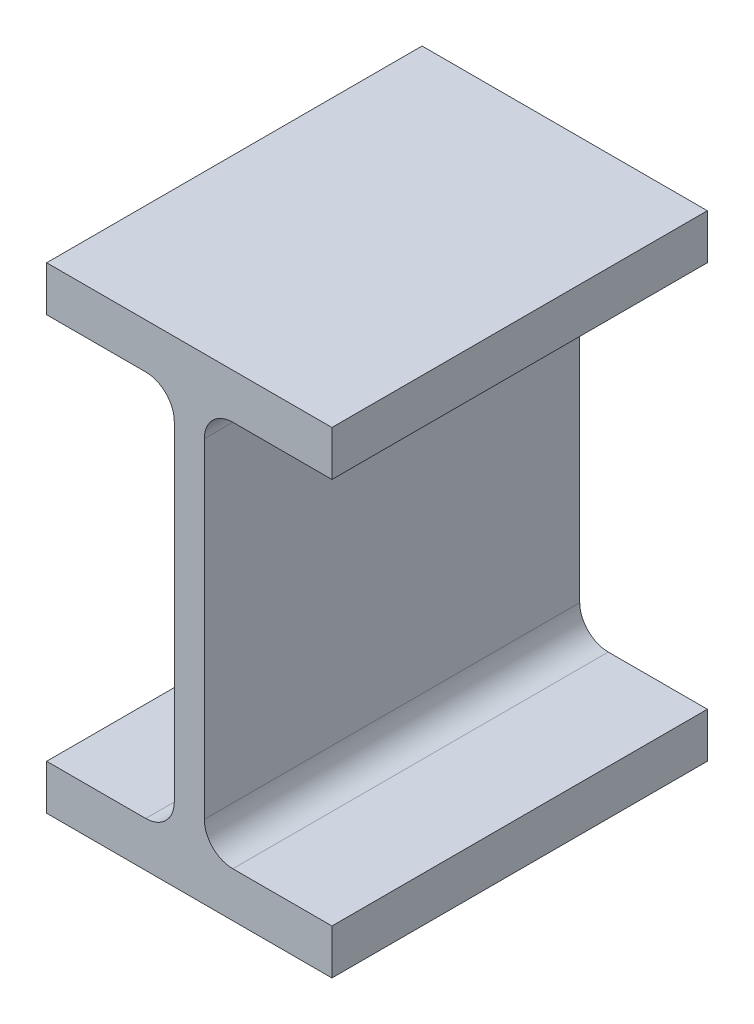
ISO-10303-21;
HEADER;
FILE_DESCRIPTION(('STEP AP214'),'2;1');
FILE_NAME('part.step','',(''),(''),'','','');
FILE_SCHEMA(('AUTOMOTIVE_DESIGN { 1 0 10303 214 1 1 1 1 }'));
ENDSEC;
DATA;
#1=APPLICATION_CONTEXT('core data for automotive mechanical design processes');
#2=APPLICATION_PROTOCOL_DEFINITION('international standard','automotive_design',2000,#1);
#3=PRODUCT_CONTEXT('',#1,'mechanical');
#4=PRODUCT('Part','Part','',(#3));
#5=PRODUCT_RELATED_PRODUCT_CATEGORY('part','',(#4));
#6=PRODUCT_DEFINITION_FORMATION('','',#4);
#7=PRODUCT_DEFINITION_CONTEXT('part definition',#1,'design');
#8=PRODUCT_DEFINITION('design','',#6,#7);
#9=PRODUCT_DEFINITION_SHAPE('','',#8);
#10=(LENGTH_UNIT() NAMED_UNIT(*) SI_UNIT(.MILLI.,.METRE.));
#11=(NAMED_UNIT(*) PLANE_ANGLE_UNIT() SI_UNIT($,.RADIAN.));
#12=(NAMED_UNIT(*) SI_UNIT($,.STERADIAN.) SOLID_ANGLE_UNIT());
#13=UNCERTAINTY_MEASURE_WITH_UNIT(LENGTH_MEASURE(1.E-05),#10,'distance_accuracy_value','');
#14=(GEOMETRIC_REPRESENTATION_CONTEXT(3) GLOBAL_UNCERTAINTY_ASSIGNED_CONTEXT((#13)) GLOBAL_UNIT_ASSIGNED_CONTEXT((#10,
#11,#12)) REPRESENTATION_CONTEXT('',''));
#15=CARTESIAN_POINT('',(0.,0.,0.));
#16=DIRECTION('',(0.,0.,1.));
#17=DIRECTION('',(1.,0.,0.));
#18=AXIS2_PLACEMENT_3D('',#15,#16,#17);
#19=CARTESIAN_POINT('',(-38.,12.,50.));
#20=DIRECTION('',(1.,0.,0.));
#21=DIRECTION('',(0.,1.,0.));
#22=AXIS2_PLACEMENT_3D('',#19,#20,#21);
#23=PLANE('',#22);
#24=DIRECTION('',(0.,-1.,0.));
#25=VECTOR('',#24,1.);
#26=CARTESIAN_POINT('',(-38.,12.,-50.));
#27=LINE('',#26,#25);
#28=CARTESIAN_POINT('',(-38.,12.,-50.));
#29=VERTEX_POINT('',#28);
#30=CARTESIAN_POINT('',(-38.,0.,-50.));
#31=VERTEX_POINT('',#30);
#32=EDGE_CURVE('E176',#29,#31,#27,.T.);
#33=ORIENTED_EDGE('',*,*,#32,.T.);
#34=DIRECTION('',(0.,0.,-1.));
#35=VECTOR('',#34,1.);
#36=CARTESIAN_POINT('',(-38.,0.,50.));
#37=LINE('',#36,#35);
#38=CARTESIAN_POINT('',(-38.,0.,50.));
#39=VERTEX_POINT('',#38);
#40=EDGE_CURVE('E11',#39,#31,#37,.T.);
#41=ORIENTED_EDGE('',*,*,#40,.F.);
#42=DIRECTION('',(0.,-1.,0.));
#43=VECTOR('',#42,1.);
#44=CARTESIAN_POINT('',(-38.,12.,50.));
#45=LINE('',#44,#43);
#46=CARTESIAN_POINT('',(-38.,12.,50.));
#47=VERTEX_POINT('',#46);
#48=EDGE_CURVE('E206',#47,#39,#45,.T.);
#49=ORIENTED_EDGE('',*,*,#48,.F.);
#50=DIRECTION('',(0.,0.,-1.));
#51=VECTOR('',#50,1.);
#52=CARTESIAN_POINT('',(-38.,12.,50.));
#53=LINE('',#52,#51);
#54=EDGE_CURVE('E172',#47,#29,#53,.T.);
#55=ORIENTED_EDGE('',*,*,#54,.T.);
#56=EDGE_LOOP('',(#33,#41,#49,#55));
#57=FACE_BOUND('',#56,.T.);
#58=ADVANCED_FACE('F32',(#57),#23,.F.);
#59=CARTESIAN_POINT('',(-38.,0.,50.));
#60=DIRECTION('',(0.,1.,0.));
#61=DIRECTION('',(-1.,0.,0.));
#62=AXIS2_PLACEMENT_3D('',#59,#60,#61);
#63=PLANE('',#62);
#64=DIRECTION('',(1.,0.,0.));
#65=VECTOR('',#64,1.);
#66=CARTESIAN_POINT('',(-38.,0.,-50.));
#67=LINE('',#66,#65);
#68=CARTESIAN_POINT('',(38.,0.,-50.));
#69=VERTEX_POINT('',#68);
#70=EDGE_CURVE('E179',#31,#69,#67,.T.);
#71=ORIENTED_EDGE('',*,*,#70,.T.);
#72=DIRECTION('',(0.,0.,-1.));
#73=VECTOR('',#72,1.);
#74=CARTESIAN_POINT('',(38.,0.,50.));
#75=LINE('',#74,#73);
#76=CARTESIAN_POINT('',(38.,0.,50.));
#77=VERTEX_POINT('',#76);
#78=EDGE_CURVE('E40',#77,#69,#75,.T.);
#79=ORIENTED_EDGE('',*,*,#78,.F.);
#80=DIRECTION('',(1.,0.,0.));
#81=VECTOR('',#80,1.);
#82=CARTESIAN_POINT('',(-38.,0.,50.));
#83=LINE('',#82,#81);
#84=EDGE_CURVE('E115',#39,#77,#83,.T.);
#85=ORIENTED_EDGE('',*,*,#84,.F.);
#86=ORIENTED_EDGE('',*,*,#40,.T.);
#87=EDGE_LOOP('',(#71,#79,#85,#86));
#88=FACE_BOUND('',#87,.T.);
#89=ADVANCED_FACE('F304',(#88),#63,.F.);
#90=CARTESIAN_POINT('',(38.,0.,50.));
#91=DIRECTION('',(-1.,0.,0.));
#92=DIRECTION('',(0.,-1.,0.));
#93=AXIS2_PLACEMENT_3D('',#90,#91,#92);
#94=PLANE('',#93);
#95=DIRECTION('',(0.,1.,0.));
#96=VECTOR('',#95,1.);
#97=CARTESIAN_POINT('',(38.,0.,-50.));
#98=LINE('',#97,#96);
#99=CARTESIAN_POINT('',(38.,12.,-50.));
#100=VERTEX_POINT('',#99);
#101=EDGE_CURVE('E181',#69,#100,#98,.T.);
#102=ORIENTED_EDGE('',*,*,#101,.T.);
#103=DIRECTION('',(0.,0.,-1.));
#104=VECTOR('',#103,1.);
#105=CARTESIAN_POINT('',(38.,12.,50.));
#106=LINE('',#105,#104);
#107=CARTESIAN_POINT('',(38.,12.,50.));
#108=VERTEX_POINT('',#107);
#109=EDGE_CURVE('E237',#108,#100,#106,.T.);
#110=ORIENTED_EDGE('',*,*,#109,.F.);
#111=DIRECTION('',(0.,1.,0.));
#112=VECTOR('',#111,1.);
#113=CARTESIAN_POINT('',(38.,0.,50.));
#114=LINE('',#113,#112);
#115=EDGE_CURVE('E245',#77,#108,#114,.T.);
#116=ORIENTED_EDGE('',*,*,#115,.F.);
#117=ORIENTED_EDGE('',*,*,#78,.T.);
#118=EDGE_LOOP('',(#102,#110,#116,#117));
#119=FACE_BOUND('',#118,.T.);
#120=ADVANCED_FACE('F243',(#119),#94,.F.);
#121=CARTESIAN_POINT('',(38.,12.,50.));
#122=DIRECTION('',(0.,-1.,0.));
#123=DIRECTION('',(1.,0.,0.));
#124=AXIS2_PLACEMENT_3D('',#121,#122,#123);
#125=PLANE('',#124);
#126=DIRECTION('',(-1.,0.,0.));
#127=VECTOR('',#126,1.);
#128=CARTESIAN_POINT('',(38.,12.,-50.));
#129=LINE('',#128,#127);
#130=CARTESIAN_POINT('',(11.6,12.,-50.));
#131=VERTEX_POINT('',#130);
#132=EDGE_CURVE('E183',#100,#131,#129,.T.);
#133=ORIENTED_EDGE('',*,*,#132,.T.);
#134=DIRECTION('',(0.,0.,-1.));
#135=VECTOR('',#134,1.);
#136=CARTESIAN_POINT('',(11.6,12.,50.));
#137=LINE('',#136,#135);
#138=CARTESIAN_POINT('',(11.6,12.,50.));
#139=VERTEX_POINT('',#138);
#140=EDGE_CURVE('E234',#139,#131,#137,.T.);
#141=ORIENTED_EDGE('',*,*,#140,.F.);
#142=DIRECTION('',(-1.,0.,0.));
#143=VECTOR('',#142,1.);
#144=CARTESIAN_POINT('',(38.,12.,50.));
#145=LINE('',#144,#143);
#146=EDGE_CURVE('E263',#108,#139,#145,.T.);
#147=ORIENTED_EDGE('',*,*,#146,.F.);
#148=ORIENTED_EDGE('',*,*,#109,.T.);
#149=EDGE_LOOP('',(#133,#141,#147,#148));
#150=FACE_BOUND('',#149,.T.);
#151=ADVANCED_FACE('F254',(#150),#125,.F.);
#152=CARTESIAN_POINT('',(11.6,19.6,50.));
#153=DIRECTION('',(0.,0.,-1.));
#154=DIRECTION('',(-1.,0.,0.));
#155=AXIS2_PLACEMENT_3D('',#152,#153,#154);
#156=CYLINDRICAL_SURFACE('',#155,7.6);
#157=CARTESIAN_POINT('',(11.6,19.6,-50.));
#158=DIRECTION('',(0.,0.,-1.));
#159=DIRECTION('',(-1.,0.,0.));
#160=AXIS2_PLACEMENT_3D('',#157,#158,#159);
#161=CIRCLE('',#160,7.6);
#162=CARTESIAN_POINT('',(4.,19.6,-50.));
#163=VERTEX_POINT('',#162);
#164=EDGE_CURVE('E185',#131,#163,#161,.T.);
#165=ORIENTED_EDGE('',*,*,#164,.T.);
#166=DIRECTION('',(0.,0.,-1.));
#167=VECTOR('',#166,1.);
#168=CARTESIAN_POINT('',(4.,19.6,50.));
#169=LINE('',#168,#167);
#170=CARTESIAN_POINT('',(4.,19.6,50.));
#171=VERTEX_POINT('',#170);
#172=EDGE_CURVE('E231',#171,#163,#169,.T.);
#173=ORIENTED_EDGE('',*,*,#172,.F.);
#174=CARTESIAN_POINT('',(11.6,19.6,50.));
#175=DIRECTION('',(0.,0.,-1.));
#176=DIRECTION('',(-1.,0.,0.));
#177=AXIS2_PLACEMENT_3D('',#174,#175,#176);
#178=CIRCLE('',#177,7.6);
#179=EDGE_CURVE('E260',#139,#171,#178,.T.);
#180=ORIENTED_EDGE('',*,*,#179,.F.);
#181=ORIENTED_EDGE('',*,*,#140,.T.);
#182=EDGE_LOOP('',(#165,#173,#180,#181));
#183=FACE_BOUND('',#182,.T.);
#184=ADVANCED_FACE('F258',(#183),#156,.F.);
#185=CARTESIAN_POINT('',(4.,19.6,50.));
#186=DIRECTION('',(-1.,0.,0.));
#187=DIRECTION('',(0.,0.,1.));
#188=AXIS2_PLACEMENT_3D('',#185,#186,#187);
#189=PLANE('',#188);
#190=DIRECTION('',(0.,1.,0.));
#191=VECTOR('',#190,1.);
#192=CARTESIAN_POINT('',(4.,19.6,-50.));
#193=LINE('',#192,#191);
#194=CARTESIAN_POINT('',(4.,107.4,-50.));
#195=VERTEX_POINT('',#194);
#196=EDGE_CURVE('E187',#163,#195,#193,.T.);
#197=ORIENTED_EDGE('',*,*,#196,.T.);
#198=DIRECTION('',(0.,0.,-1.));
#199=VECTOR('',#198,1.);
#200=CARTESIAN_POINT('',(4.,107.4,50.));
#201=LINE('',#200,#199);
#202=CARTESIAN_POINT('',(4.,107.4,50.));
#203=VERTEX_POINT('',#202);
#204=EDGE_CURVE('E228',#203,#195,#201,.T.);
#205=ORIENTED_EDGE('',*,*,#204,.F.);
#206=DIRECTION('',(0.,1.,0.));
#207=VECTOR('',#206,1.);
#208=CARTESIAN_POINT('',(4.,19.6,50.));
#209=LINE('',#208,#207);
#210=EDGE_CURVE('E262',#171,#203,#209,.T.);
#211=ORIENTED_EDGE('',*,*,#210,.F.);
#212=ORIENTED_EDGE('',*,*,#172,.T.);
#213=EDGE_LOOP('',(#197,#205,#211,#212));
#214=FACE_BOUND('',#213,.T.);
#215=ADVANCED_FACE('F317',(#214),#189,.F.);
#216=CARTESIAN_POINT('',(11.6,107.4,50.));
#217=DIRECTION('',(0.,0.,-1.));
#218=DIRECTION('',(-1.,0.,0.));
#219=AXIS2_PLACEMENT_3D('',#216,#217,#218);
#220=CYLINDRICAL_SURFACE('',#219,7.6);
#221=CARTESIAN_POINT('',(11.6,107.4,-50.));
#222=DIRECTION('',(0.,0.,-1.));
#223=DIRECTION('',(-1.,0.,0.));
#224=AXIS2_PLACEMENT_3D('',#221,#222,#223);
#225=CIRCLE('',#224,7.6);
#226=CARTESIAN_POINT('',(11.6,115.,-50.));
#227=VERTEX_POINT('',#226);
#228=EDGE_CURVE('E189',#195,#227,#225,.T.);
#229=ORIENTED_EDGE('',*,*,#228,.T.);
#230=DIRECTION('',(0.,0.,-1.));
#231=VECTOR('',#230,1.);
#232=CARTESIAN_POINT('',(11.6,115.,50.));
#233=LINE('',#232,#231);
#234=CARTESIAN_POINT('',(11.6,115.,50.));
#235=VERTEX_POINT('',#234);
#236=EDGE_CURVE('E225',#235,#227,#233,.T.);
#237=ORIENTED_EDGE('',*,*,#236,.F.);
#238=CARTESIAN_POINT('',(11.6,107.4,50.));
#239=DIRECTION('',(0.,0.,-1.));
#240=DIRECTION('',(-1.,0.,0.));
#241=AXIS2_PLACEMENT_3D('',#238,#239,#240);
#242=CIRCLE('',#241,7.6);
#243=EDGE_CURVE('E265',#203,#235,#242,.T.);
#244=ORIENTED_EDGE('',*,*,#243,.F.);
#245=ORIENTED_EDGE('',*,*,#204,.T.);
#246=EDGE_LOOP('',(#229,#237,#244,#245));
#247=FACE_BOUND('',#246,.T.);
#248=ADVANCED_FACE('F320',(#247),#220,.F.);
#249=CARTESIAN_POINT('',(11.6,115.,50.));
#250=DIRECTION('',(0.,1.,0.));
#251=DIRECTION('',(-1.,0.,0.));
#252=AXIS2_PLACEMENT_3D('',#249,#250,#251);
#253=PLANE('',#252);
#254=DIRECTION('',(1.,0.,0.));
#255=VECTOR('',#254,1.);
#256=CARTESIAN_POINT('',(11.6,115.,-50.));
#257=LINE('',#256,#255);
#258=CARTESIAN_POINT('',(38.,115.,-50.));
#259=VERTEX_POINT('',#258);
#260=EDGE_CURVE('E191',#227,#259,#257,.T.);
#261=ORIENTED_EDGE('',*,*,#260,.T.);
#262=DIRECTION('',(0.,0.,-1.));
#263=VECTOR('',#262,1.);
#264=CARTESIAN_POINT('',(38.,115.,50.));
#265=LINE('',#264,#263);
#266=CARTESIAN_POINT('',(38.,115.,50.));
#267=VERTEX_POINT('',#266);
#268=EDGE_CURVE('E222',#267,#259,#265,.T.);
#269=ORIENTED_EDGE('',*,*,#268,.F.);
#270=DIRECTION('',(1.,0.,0.));
#271=VECTOR('',#270,1.);
#272=CARTESIAN_POINT('',(11.6,115.,50.));
#273=LINE('',#272,#271);
#274=EDGE_CURVE('E271',#235,#267,#273,.T.);
#275=ORIENTED_EDGE('',*,*,#274,.F.);
#276=ORIENTED_EDGE('',*,*,#236,.T.);
#277=EDGE_LOOP('',(#261,#269,#275,#276));
#278=FACE_BOUND('',#277,.T.);
#279=ADVANCED_FACE('F324',(#278),#253,.F.);
#280=CARTESIAN_POINT('',(38.,115.,50.));
#281=DIRECTION('',(-1.,0.,0.));
#282=DIRECTION('',(0.,0.,1.));
#283=AXIS2_PLACEMENT_3D('',#280,#281,#282);
#284=PLANE('',#283);
#285=DIRECTION('',(0.,1.,0.));
#286=VECTOR('',#285,1.);
#287=CARTESIAN_POINT('',(38.,115.,-50.));
#288=LINE('',#287,#286);
#289=CARTESIAN_POINT('',(38.,127.,-50.));
#290=VERTEX_POINT('',#289);
#291=EDGE_CURVE('E193',#259,#290,#288,.T.);
#292=ORIENTED_EDGE('',*,*,#291,.T.);
#293=DIRECTION('',(0.,0.,-1.));
#294=VECTOR('',#293,1.);
#295=CARTESIAN_POINT('',(38.,127.,50.));
#296=LINE('',#295,#294);
#297=CARTESIAN_POINT('',(38.,127.,50.));
#298=VERTEX_POINT('',#297);
#299=EDGE_CURVE('E219',#298,#290,#296,.T.);
#300=ORIENTED_EDGE('',*,*,#299,.F.);
#301=DIRECTION('',(0.,1.,0.));
#302=VECTOR('',#301,1.);
#303=CARTESIAN_POINT('',(38.,115.,50.));
#304=LINE('',#303,#302);
#305=EDGE_CURVE('E273',#267,#298,#304,.T.);
#306=ORIENTED_EDGE('',*,*,#305,.F.);
#307=ORIENTED_EDGE('',*,*,#268,.T.);
#308=EDGE_LOOP('',(#292,#300,#306,#307));
#309=FACE_BOUND('',#308,.T.);
#310=ADVANCED_FACE('F328',(#309),#284,.F.);
#311=CARTESIAN_POINT('',(38.,127.,50.));
#312=DIRECTION('',(0.,-1.,0.));
#313=DIRECTION('',(1.,0.,0.));
#314=AXIS2_PLACEMENT_3D('',#311,#312,#313);
#315=PLANE('',#314);
#316=DIRECTION('',(-1.,0.,0.));
#317=VECTOR('',#316,1.);
#318=CARTESIAN_POINT('',(38.,127.,-50.));
#319=LINE('',#318,#317);
#320=CARTESIAN_POINT('',(-38.,127.,-50.));
#321=VERTEX_POINT('',#320);
#322=EDGE_CURVE('E195',#290,#321,#319,.T.);
#323=ORIENTED_EDGE('',*,*,#322,.T.);
#324=DIRECTION('',(0.,0.,-1.));
#325=VECTOR('',#324,1.);
#326=CARTESIAN_POINT('',(-38.,127.,50.));
#327=LINE('',#326,#325);
#328=CARTESIAN_POINT('',(-38.,127.,50.));
#329=VERTEX_POINT('',#328);
#330=EDGE_CURVE('E216',#329,#321,#327,.T.);
#331=ORIENTED_EDGE('',*,*,#330,.F.);
#332=DIRECTION('',(-1.,0.,0.));
#333=VECTOR('',#332,1.);
#334=CARTESIAN_POINT('',(38.,127.,50.));
#335=LINE('',#334,#333);
#336=EDGE_CURVE('E275',#298,#329,#335,.T.);
#337=ORIENTED_EDGE('',*,*,#336,.F.);
#338=ORIENTED_EDGE('',*,*,#299,.T.);
#339=EDGE_LOOP('',(#323,#331,#337,#338));
#340=FACE_BOUND('',#339,.T.);
#341=ADVANCED_FACE('F332',(#340),#315,.F.);
#342=CARTESIAN_POINT('',(-38.,127.,50.));
#343=DIRECTION('',(1.,0.,0.));
#344=DIRECTION('',(0.,0.,-1.));
#345=AXIS2_PLACEMENT_3D('',#342,#343,#344);
#346=PLANE('',#345);
#347=DIRECTION('',(0.,-1.,0.));
#348=VECTOR('',#347,1.);
#349=CARTESIAN_POINT('',(-38.,127.,-50.));
#350=LINE('',#349,#348);
#351=CARTESIAN_POINT('',(-38.,115.,-50.));
#352=VERTEX_POINT('',#351);
#353=EDGE_CURVE('E197',#321,#352,#350,.T.);
#354=ORIENTED_EDGE('',*,*,#353,.T.);
#355=DIRECTION('',(0.,0.,-1.));
#356=VECTOR('',#355,1.);
#357=CARTESIAN_POINT('',(-38.,115.,50.));
#358=LINE('',#357,#356);
#359=CARTESIAN_POINT('',(-38.,115.,50.));
#360=VERTEX_POINT('',#359);
#361=EDGE_CURVE('E213',#360,#352,#358,.T.);
#362=ORIENTED_EDGE('',*,*,#361,.F.);
#363=DIRECTION('',(0.,-1.,0.));
#364=VECTOR('',#363,1.);
#365=CARTESIAN_POINT('',(-38.,127.,50.));
#366=LINE('',#365,#364);
#367=EDGE_CURVE('E277',#329,#360,#366,.T.);
#368=ORIENTED_EDGE('',*,*,#367,.F.);
#369=ORIENTED_EDGE('',*,*,#330,.T.);
#370=EDGE_LOOP('',(#354,#362,#368,#369));
#371=FACE_BOUND('',#370,.T.);
#372=ADVANCED_FACE('F336',(#371),#346,.F.);
#373=CARTESIAN_POINT('',(-38.,115.,50.));
#374=DIRECTION('',(0.,1.,0.));
#375=DIRECTION('',(0.,0.,1.));
#376=AXIS2_PLACEMENT_3D('',#373,#374,#375);
#377=PLANE('',#376);
#378=DIRECTION('',(1.,0.,0.));
#379=VECTOR('',#378,1.);
#380=CARTESIAN_POINT('',(-38.,115.,-50.));
#381=LINE('',#380,#379);
#382=CARTESIAN_POINT('',(-11.6,115.,-50.));
#383=VERTEX_POINT('',#382);
#384=EDGE_CURVE('E199',#352,#383,#381,.T.);
#385=ORIENTED_EDGE('',*,*,#384,.T.);
#386=DIRECTION('',(0.,0.,-1.));
#387=VECTOR('',#386,1.);
#388=CARTESIAN_POINT('',(-11.6,115.,50.));
#389=LINE('',#388,#387);
#390=CARTESIAN_POINT('',(-11.6,115.,50.));
#391=VERTEX_POINT('',#390);
#392=EDGE_CURVE('E210',#391,#383,#389,.T.);
#393=ORIENTED_EDGE('',*,*,#392,.F.);
#394=DIRECTION('',(1.,0.,0.));
#395=VECTOR('',#394,1.);
#396=CARTESIAN_POINT('',(-38.,115.,50.));
#397=LINE('',#396,#395);
#398=EDGE_CURVE('E279',#360,#391,#397,.T.);
#399=ORIENTED_EDGE('',*,*,#398,.F.);
#400=ORIENTED_EDGE('',*,*,#361,.T.);
#401=EDGE_LOOP('',(#385,#393,#399,#400));
#402=FACE_BOUND('',#401,.T.);
#403=ADVANCED_FACE('F285',(#402),#377,.F.);
#404=CARTESIAN_POINT('',(-11.6,107.4,50.));
#405=DIRECTION('',(0.,0.,-1.));
#406=DIRECTION('',(-1.,0.,0.));
#407=AXIS2_PLACEMENT_3D('',#404,#405,#406);
#408=CYLINDRICAL_SURFACE('',#407,7.6);
#409=CARTESIAN_POINT('',(-11.6,107.4,-50.));
#410=DIRECTION('',(0.,0.,-1.));
#411=DIRECTION('',(-1.,0.,0.));
#412=AXIS2_PLACEMENT_3D('',#409,#410,#411);
#413=CIRCLE('',#412,7.6);
#414=CARTESIAN_POINT('',(-4.00000000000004,107.4,-50.));
#415=VERTEX_POINT('',#414);
#416=EDGE_CURVE('E201',#383,#415,#413,.T.);
#417=ORIENTED_EDGE('',*,*,#416,.T.);
#418=DIRECTION('',(0.,0.,-1.));
#419=VECTOR('',#418,1.);
#420=CARTESIAN_POINT('',(-4.00000000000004,107.4,50.));
#421=LINE('',#420,#419);
#422=CARTESIAN_POINT('',(-4.00000000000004,107.4,50.));
#423=VERTEX_POINT('',#422);
#424=EDGE_CURVE('E167',#423,#415,#421,.T.);
#425=ORIENTED_EDGE('',*,*,#424,.F.);
#426=CARTESIAN_POINT('',(-11.6,107.4,50.));
#427=DIRECTION('',(0.,0.,-1.));
#428=DIRECTION('',(-1.,0.,0.));
#429=AXIS2_PLACEMENT_3D('',#426,#427,#428);
#430=CIRCLE('',#429,7.6);
#431=EDGE_CURVE('E158',#391,#423,#430,.T.);
#432=ORIENTED_EDGE('',*,*,#431,.F.);
#433=ORIENTED_EDGE('',*,*,#392,.T.);
#434=EDGE_LOOP('',(#417,#425,#432,#433));
#435=FACE_BOUND('',#434,.T.);
#436=ADVANCED_FACE('F289',(#435),#408,.F.);
#437=CARTESIAN_POINT('',(-4.00000000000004,107.4,50.));
#438=DIRECTION('',(1.,0.,0.));
#439=DIRECTION('',(0.,1.,0.));
#440=AXIS2_PLACEMENT_3D('',#437,#438,#439);
#441=PLANE('',#440);
#442=DIRECTION('',(0.,-1.,0.));
#443=VECTOR('',#442,1.);
#444=CARTESIAN_POINT('',(-4.00000000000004,107.4,-50.));
#445=LINE('',#444,#443);
#446=CARTESIAN_POINT('',(-4.,19.6,-50.));
#447=VERTEX_POINT('',#446);
#448=EDGE_CURVE('E166',#415,#447,#445,.T.);
#449=ORIENTED_EDGE('',*,*,#448,.T.);
#450=DIRECTION('',(0.,0.,-1.));
#451=VECTOR('',#450,1.);
#452=CARTESIAN_POINT('',(-4.,19.6,50.));
#453=LINE('',#452,#451);
#454=CARTESIAN_POINT('',(-4.,19.6,50.));
#455=VERTEX_POINT('',#454);
#456=EDGE_CURVE('E163',#455,#447,#453,.T.);
#457=ORIENTED_EDGE('',*,*,#456,.F.);
#458=DIRECTION('',(0.,-1.,0.));
#459=VECTOR('',#458,1.);
#460=CARTESIAN_POINT('',(-4.00000000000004,107.4,50.));
#461=LINE('',#460,#459);
#462=EDGE_CURVE('E152',#423,#455,#461,.T.);
#463=ORIENTED_EDGE('',*,*,#462,.F.);
#464=ORIENTED_EDGE('',*,*,#424,.T.);
#465=EDGE_LOOP('',(#449,#457,#463,#464));
#466=FACE_BOUND('',#465,.T.);
#467=ADVANCED_FACE('F164',(#466),#441,.F.);
#468=CARTESIAN_POINT('',(-11.6,19.6,50.));
#469=DIRECTION('',(0.,0.,-1.));
#470=DIRECTION('',(-1.,0.,0.));
#471=AXIS2_PLACEMENT_3D('',#468,#469,#470);
#472=CYLINDRICAL_SURFACE('',#471,7.6);
#473=CARTESIAN_POINT('',(-11.6,19.6,-50.));
#474=DIRECTION('',(0.,0.,-1.));
#475=DIRECTION('',(-1.,0.,0.));
#476=AXIS2_PLACEMENT_3D('',#473,#474,#475);
#477=CIRCLE('',#476,7.6);
#478=CARTESIAN_POINT('',(-11.6,12.,-50.));
#479=VERTEX_POINT('',#478);
#480=EDGE_CURVE('E101',#447,#479,#477,.T.);
#481=ORIENTED_EDGE('',*,*,#480,.T.);
#482=DIRECTION('',(0.,0.,-1.));
#483=VECTOR('',#482,1.);
#484=CARTESIAN_POINT('',(-11.6,12.,50.));
#485=LINE('',#484,#483);
#486=CARTESIAN_POINT('',(-11.6,12.,50.));
#487=VERTEX_POINT('',#486);
#488=EDGE_CURVE('E168',#487,#479,#485,.T.);
#489=ORIENTED_EDGE('',*,*,#488,.F.);
#490=CARTESIAN_POINT('',(-11.6,19.6,50.));
#491=DIRECTION('',(0.,0.,-1.));
#492=DIRECTION('',(-1.,0.,0.));
#493=AXIS2_PLACEMENT_3D('',#490,#491,#492);
#494=CIRCLE('',#493,7.6);
#495=EDGE_CURVE('E156',#455,#487,#494,.T.);
#496=ORIENTED_EDGE('',*,*,#495,.F.);
#497=ORIENTED_EDGE('',*,*,#456,.T.);
#498=EDGE_LOOP('',(#481,#489,#496,#497));
#499=FACE_BOUND('',#498,.T.);
#500=ADVANCED_FACE('F170',(#499),#472,.F.);
#501=CARTESIAN_POINT('',(-11.6,12.,50.));
#502=DIRECTION('',(0.,-1.,0.));
#503=DIRECTION('',(1.,0.,0.));
#504=AXIS2_PLACEMENT_3D('',#501,#502,#503);
#505=PLANE('',#504);
#506=DIRECTION('',(-1.,0.,0.));
#507=VECTOR('',#506,1.);
#508=CARTESIAN_POINT('',(-11.6,12.,-50.));
#509=LINE('',#508,#507);
#510=EDGE_CURVE('E107',#479,#29,#509,.T.);
#511=ORIENTED_EDGE('',*,*,#510,.T.);
#512=ORIENTED_EDGE('',*,*,#54,.F.);
#513=DIRECTION('',(-1.,0.,0.));
#514=VECTOR('',#513,1.);
#515=CARTESIAN_POINT('',(-11.6,12.,50.));
#516=LINE('',#515,#514);
#517=EDGE_CURVE('E48',#487,#47,#516,.T.);
#518=ORIENTED_EDGE('',*,*,#517,.F.);
#519=ORIENTED_EDGE('',*,*,#488,.T.);
#520=EDGE_LOOP('',(#511,#512,#518,#519));
#521=FACE_BOUND('',#520,.T.);
#522=ADVANCED_FACE('F293',(#521),#505,.F.);
#523=CARTESIAN_POINT('',(11.6,19.6,50.));
#524=DIRECTION('',(0.,0.,-1.));
#525=DIRECTION('',(-1.,0.,0.));
#526=AXIS2_PLACEMENT_3D('',#523,#524,#525);
#527=PLANE('',#526);
#528=ORIENTED_EDGE('',*,*,#48,.T.);
#529=ORIENTED_EDGE('',*,*,#84,.T.);
#530=ORIENTED_EDGE('',*,*,#115,.T.);
#531=ORIENTED_EDGE('',*,*,#146,.T.);
#532=ORIENTED_EDGE('',*,*,#179,.T.);
#533=ORIENTED_EDGE('',*,*,#210,.T.);
#534=ORIENTED_EDGE('',*,*,#243,.T.);
#535=ORIENTED_EDGE('',*,*,#274,.T.);
#536=ORIENTED_EDGE('',*,*,#305,.T.);
#537=ORIENTED_EDGE('',*,*,#336,.T.);
#538=ORIENTED_EDGE('',*,*,#367,.T.);
#539=ORIENTED_EDGE('',*,*,#398,.T.);
#540=ORIENTED_EDGE('',*,*,#431,.T.);
#541=ORIENTED_EDGE('',*,*,#462,.T.);
#542=ORIENTED_EDGE('',*,*,#495,.T.);
#543=ORIENTED_EDGE('',*,*,#517,.T.);
#544=EDGE_LOOP('',(#528,#529,#530,#531,#532,#533,#534,#535,#536,#537,#538,#539,#540,#541,#542,#543));
#545=FACE_BOUND('',#544,.T.);
#546=ADVANCED_FACE('F154',(#545),#527,.F.);
#547=CARTESIAN_POINT('',(11.6,19.6,-50.));
#548=DIRECTION('',(0.,0.,-1.));
#549=DIRECTION('',(-1.,0.,0.));
#550=AXIS2_PLACEMENT_3D('',#547,#548,#549);
#551=PLANE('',#550);
#552=ORIENTED_EDGE('',*,*,#32,.F.);
#553=ORIENTED_EDGE('',*,*,#510,.F.);
#554=ORIENTED_EDGE('',*,*,#480,.F.);
#555=ORIENTED_EDGE('',*,*,#448,.F.);
#556=ORIENTED_EDGE('',*,*,#416,.F.);
#557=ORIENTED_EDGE('',*,*,#384,.F.);
#558=ORIENTED_EDGE('',*,*,#353,.F.);
#559=ORIENTED_EDGE('',*,*,#322,.F.);
#560=ORIENTED_EDGE('',*,*,#291,.F.);
#561=ORIENTED_EDGE('',*,*,#260,.F.);
#562=ORIENTED_EDGE('',*,*,#228,.F.);
#563=ORIENTED_EDGE('',*,*,#196,.F.);
#564=ORIENTED_EDGE('',*,*,#164,.F.);
#565=ORIENTED_EDGE('',*,*,#132,.F.);
#566=ORIENTED_EDGE('',*,*,#101,.F.);
#567=ORIENTED_EDGE('',*,*,#70,.F.);
#568=EDGE_LOOP('',(#552,#553,#554,#555,#556,#557,#558,#559,#560,#561,#562,#563,#564,#565,#566,#567));
#569=FACE_BOUND('',#568,.T.);
#570=ADVANCED_FACE('F249',(#569),#551,.T.);
#571=CLOSED_SHELL('',(#58,#89,#120,#151,#184,#215,#248,#279,#310,#341,#372,#403,#436,#467,#500,
#522,#546,#570));
#572=MANIFOLD_SOLID_BREP('B2',#571);
#573=ADVANCED_BREP_SHAPE_REPRESENTATION('',(#18,#572),#14);
#574=SHAPE_DEFINITION_REPRESENTATION(#9,#573);
ENDSEC;
END-ISO-10303-21;
